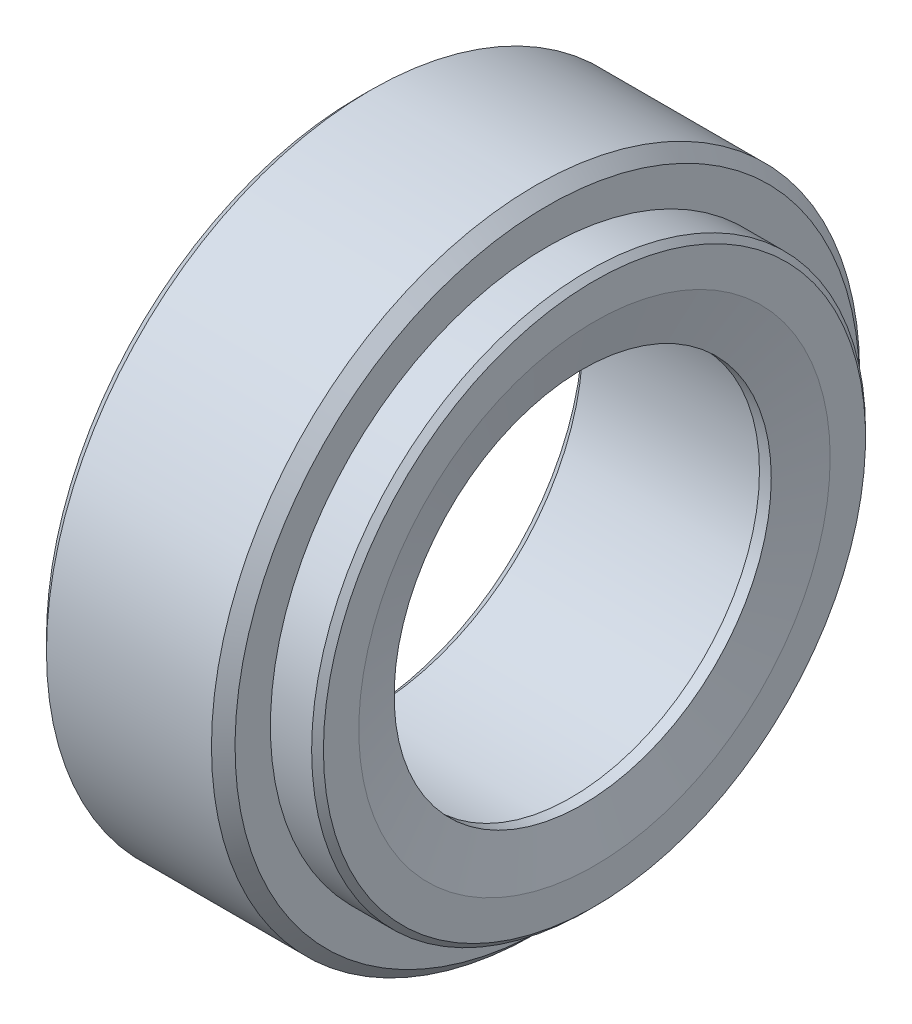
ISO-10303-21;
HEADER;
FILE_DESCRIPTION(('STEP AP214'),'2;1');
FILE_NAME('part.step','',(''),(''),'','','');
FILE_SCHEMA(('AUTOMOTIVE_DESIGN { 1 0 10303 214 1 1 1 1 }'));
ENDSEC;
DATA;
#1=APPLICATION_CONTEXT('core data for automotive mechanical design processes');
#2=APPLICATION_PROTOCOL_DEFINITION('international standard','automotive_design',2000,#1);
#3=PRODUCT_CONTEXT('',#1,'mechanical');
#4=PRODUCT('Part','Part','',(#3));
#5=PRODUCT_RELATED_PRODUCT_CATEGORY('part','',(#4));
#6=PRODUCT_DEFINITION_FORMATION('','',#4);
#7=PRODUCT_DEFINITION_CONTEXT('part definition',#1,'design');
#8=PRODUCT_DEFINITION('design','',#6,#7);
#9=PRODUCT_DEFINITION_SHAPE('','',#8);
#10=(LENGTH_UNIT() NAMED_UNIT(*) SI_UNIT(.MILLI.,.METRE.));
#11=(NAMED_UNIT(*) PLANE_ANGLE_UNIT() SI_UNIT($,.RADIAN.));
#12=(NAMED_UNIT(*) SI_UNIT($,.STERADIAN.) SOLID_ANGLE_UNIT());
#13=UNCERTAINTY_MEASURE_WITH_UNIT(LENGTH_MEASURE(1.E-05),#10,'distance_accuracy_value','');
#14=(GEOMETRIC_REPRESENTATION_CONTEXT(3) GLOBAL_UNCERTAINTY_ASSIGNED_CONTEXT((#13)) GLOBAL_UNIT_ASSIGNED_CONTEXT((#10,
#11,#12)) REPRESENTATION_CONTEXT('',''));
#15=CARTESIAN_POINT('',(0.,0.,0.));
#16=DIRECTION('',(0.,0.,1.));
#17=DIRECTION('',(1.,0.,0.));
#18=AXIS2_PLACEMENT_3D('',#15,#16,#17);
#19=CARTESIAN_POINT('',(4.83168306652,0.,0.));
#20=DIRECTION('',(1.,0.,0.));
#21=DIRECTION('',(0.,0.,-1.));
#22=AXIS2_PLACEMENT_3D('',#19,#20,#21);
#23=CYLINDRICAL_SURFACE('',#22,16.);
#24=CARTESIAN_POINT('',(5.83168306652,0.,0.));
#25=DIRECTION('',(1.,0.,0.));
#26=DIRECTION('',(0.,0.,-1.));
#27=AXIS2_PLACEMENT_3D('',#24,#25,#26);
#28=CIRCLE('',#27,16.);
#29=CARTESIAN_POINT('',(5.83168306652,0.,-16.));
#30=VERTEX_POINT('',#29);
#31=EDGE_CURVE('E77',#30,#30,#28,.T.);
#32=ORIENTED_EDGE('',*,*,#31,.T.);
#33=EDGE_LOOP('',(#32));
#34=FACE_BOUND('',#33,.T.);
#35=CARTESIAN_POINT('',(4.83168306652,0.,0.));
#36=DIRECTION('',(1.,0.,0.));
#37=DIRECTION('',(0.,0.,-1.));
#38=AXIS2_PLACEMENT_3D('',#35,#36,#37);
#39=CIRCLE('',#38,16.);
#40=CARTESIAN_POINT('',(4.83168306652,0.,-16.));
#41=VERTEX_POINT('',#40);
#42=EDGE_CURVE('E21',#41,#41,#39,.T.);
#43=ORIENTED_EDGE('',*,*,#42,.F.);
#44=EDGE_LOOP('',(#43));
#45=FACE_BOUND('',#44,.T.);
#46=ADVANCED_FACE('F17',(#34,#45),#23,.F.);
#47=CARTESIAN_POINT('',(6.83168306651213,0.,0.));
#48=DIRECTION('',(1.,0.,0.));
#49=DIRECTION('',(0.,0.,-1.));
#50=AXIS2_PLACEMENT_3D('',#47,#48,#49);
#51=CONICAL_SURFACE('',#50,20.000000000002,1.32581766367);
#52=ORIENTED_EDGE('',*,*,#31,.F.);
#53=EDGE_LOOP('',(#52));
#54=FACE_BOUND('',#53,.T.);
#55=CARTESIAN_POINT('',(6.83168306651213,0.,0.));
#56=DIRECTION('',(1.,0.,0.));
#57=DIRECTION('',(0.,0.,-1.));
#58=AXIS2_PLACEMENT_3D('',#55,#56,#57);
#59=CIRCLE('',#58,20.000000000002);
#60=CARTESIAN_POINT('',(6.83168306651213,0.,-20.000000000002));
#61=VERTEX_POINT('',#60);
#62=EDGE_CURVE('E102',#61,#61,#59,.F.);
#63=ORIENTED_EDGE('',*,*,#62,.F.);
#64=EDGE_LOOP('',(#63));
#65=FACE_BOUND('',#64,.T.);
#66=ADVANCED_FACE('F113',(#54,#65),#51,.F.);
#67=CARTESIAN_POINT('',(4.83168306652,17.,0.));
#68=DIRECTION('',(-1.,0.,0.));
#69=DIRECTION('',(0.,0.,1.));
#70=AXIS2_PLACEMENT_3D('',#67,#68,#69);
#71=PLANE('',#70);
#72=ORIENTED_EDGE('',*,*,#42,.T.);
#73=EDGE_LOOP('',(#72));
#74=FACE_BOUND('',#73,.T.);
#75=CARTESIAN_POINT('',(4.83168306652,0.,0.));
#76=DIRECTION('',(1.,0.,0.));
#77=DIRECTION('',(0.,0.,-1.));
#78=AXIS2_PLACEMENT_3D('',#75,#76,#77);
#79=CIRCLE('',#78,18.);
#80=CARTESIAN_POINT('',(4.83168306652,0.,-18.));
#81=VERTEX_POINT('',#80);
#82=EDGE_CURVE('E58',#81,#81,#79,.F.);
#83=ORIENTED_EDGE('',*,*,#82,.T.);
#84=EDGE_LOOP('',(#83));
#85=FACE_BOUND('',#84,.T.);
#86=ADVANCED_FACE('F109',(#74,#85),#71,.T.);
#87=CARTESIAN_POINT('',(6.83168306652,21.75,0.));
#88=DIRECTION('',(1.,0.,0.));
#89=DIRECTION('',(0.,0.,-1.));
#90=AXIS2_PLACEMENT_3D('',#87,#88,#89);
#91=PLANE('',#90);
#92=ORIENTED_EDGE('',*,*,#62,.T.);
#93=EDGE_LOOP('',(#92));
#94=FACE_BOUND('',#93,.T.);
#95=CARTESIAN_POINT('',(6.83168306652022,0.,0.));
#96=DIRECTION('',(-1.,0.,0.));
#97=DIRECTION('',(0.,0.,1.));
#98=AXIS2_PLACEMENT_3D('',#95,#96,#97);
#99=CIRCLE('',#98,23.0000000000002);
#100=CARTESIAN_POINT('',(6.83168306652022,0.,23.0000000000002));
#101=VERTEX_POINT('',#100);
#102=EDGE_CURVE('E76',#101,#101,#99,.T.);
#103=ORIENTED_EDGE('',*,*,#102,.F.);
#104=EDGE_LOOP('',(#103));
#105=FACE_BOUND('',#104,.T.);
#106=ADVANCED_FACE('F185',(#94,#105),#91,.T.);
#107=CARTESIAN_POINT('',(-12.1683169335,0.,0.));
#108=DIRECTION('',(1.,0.,0.));
#109=DIRECTION('',(0.,0.,-1.));
#110=AXIS2_PLACEMENT_3D('',#107,#108,#109);
#111=CYLINDRICAL_SURFACE('',#110,18.);
#112=CARTESIAN_POINT('',(-12.1683169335,0.,0.));
#113=DIRECTION('',(-1.,0.,0.));
#114=DIRECTION('',(0.,0.,1.));
#115=AXIS2_PLACEMENT_3D('',#112,#113,#114);
#116=CIRCLE('',#115,18.);
#117=CARTESIAN_POINT('',(-12.1683169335,0.,18.));
#118=VERTEX_POINT('',#117);
#119=EDGE_CURVE('E73',#118,#118,#116,.T.);
#120=ORIENTED_EDGE('',*,*,#119,.T.);
#121=EDGE_LOOP('',(#120));
#122=FACE_BOUND('',#121,.T.);
#123=ORIENTED_EDGE('',*,*,#82,.F.);
#124=EDGE_LOOP('',(#123));
#125=FACE_BOUND('',#124,.T.);
#126=ADVANCED_FACE('F182',(#122,#125),#111,.F.);
#127=CARTESIAN_POINT('',(-5.16831693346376,-0.0258203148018,21.999984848));
#128=DIRECTION('',(-1.,0.,0.));
#129=DIRECTION('',(0.,0.,1.));
#130=AXIS2_PLACEMENT_3D('',#127,#128,#129);
#131=CONICAL_SURFACE('',#130,1.49999999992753,1.02974425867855);
#132=DIRECTION('',(0.515038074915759,0.,0.857167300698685));
#133=VECTOR('',#132,1.);
#134=CARTESIAN_POINT('',(-299820.497000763,-0.0258203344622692,-498956.000030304));
#135=LINE('',#134,#133);
#136=CARTESIAN_POINT('',(-4.26702600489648,-0.0258203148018,21.9999848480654));
#137=VERTEX_POINT('',#136);
#138=CARTESIAN_POINT('',(-5.16831693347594,-0.0258203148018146,20.4999848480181));
#139=VERTEX_POINT('',#138);
#140=EDGE_CURVE('E52',#137,#139,#135,.F.);
#141=ORIENTED_EDGE('',*,*,#140,.T.);
#142=CARTESIAN_POINT('',(-5.16831693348,-0.0258203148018,21.999984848));
#143=DIRECTION('',(-1.,0.,0.));
#144=DIRECTION('',(0.,0.,1.));
#145=AXIS2_PLACEMENT_3D('',#142,#143,#144);
#146=CIRCLE('',#145,1.5);
#147=CARTESIAN_POINT('',(-5.16831693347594,-0.0258203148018,23.4999848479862));
#148=VERTEX_POINT('',#147);
#149=EDGE_CURVE('E55',#139,#148,#146,.T.);
#150=ORIENTED_EDGE('',*,*,#149,.T.);
#151=DIRECTION('',(0.515038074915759,0.,-0.857167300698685));
#152=VECTOR('',#151,1.);
#153=CARTESIAN_POINT('',(-299820.497000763,-0.0258203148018,499000.));
#154=LINE('',#153,#152);
#155=EDGE_CURVE('E49',#148,#137,#154,.T.);
#156=ORIENTED_EDGE('',*,*,#155,.T.);
#157=EDGE_LOOP('',(#141,#150,#156));
#158=FACE_BOUND('',#157,.T.);
#159=ADVANCED_FACE('F51',(#158),#131,.F.);
#160=CARTESIAN_POINT('',(-5.16831693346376,-0.0258203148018,21.999984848));
#161=DIRECTION('',(-1.,0.,0.));
#162=DIRECTION('',(0.,0.,1.));
#163=AXIS2_PLACEMENT_3D('',#160,#161,#162);
#164=CONICAL_SURFACE('',#163,1.49999999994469,1.02974425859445);
#165=ORIENTED_EDGE('',*,*,#155,.F.);
#166=CARTESIAN_POINT('',(-5.16831693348,-0.0258203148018,21.999984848));
#167=DIRECTION('',(-1.,0.,0.));
#168=DIRECTION('',(0.,0.,1.));
#169=AXIS2_PLACEMENT_3D('',#166,#167,#168);
#170=CIRCLE('',#169,1.5);
#171=EDGE_CURVE('E61',#148,#139,#170,.T.);
#172=ORIENTED_EDGE('',*,*,#171,.T.);
#173=ORIENTED_EDGE('',*,*,#140,.F.);
#174=EDGE_LOOP('',(#165,#172,#173));
#175=FACE_BOUND('',#174,.T.);
#176=ADVANCED_FACE('F60',(#175),#164,.F.);
#177=CARTESIAN_POINT('',(-5.1683169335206,-0.0258203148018,-21.999984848));
#178=DIRECTION('',(-1.,0.,0.));
#179=DIRECTION('',(0.,0.,1.));
#180=AXIS2_PLACEMENT_3D('',#177,#178,#179);
#181=CONICAL_SURFACE('',#180,1.49999999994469,1.02974425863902);
#182=DIRECTION('',(0.515038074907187,0.,0.857167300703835));
#183=VECTOR('',#182,1.);
#184=CARTESIAN_POINT('',(-299846.934843,-0.0258203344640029,-499043.999969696));
#185=LINE('',#184,#183);
#186=CARTESIAN_POINT('',(-4.26702600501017,-0.0258203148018,-21.9999848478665));
#187=VERTEX_POINT('',#186);
#188=CARTESIAN_POINT('',(-5.16831693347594,-0.0258203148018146,-23.4999848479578));
#189=VERTEX_POINT('',#188);
#190=EDGE_CURVE('E36',#187,#189,#185,.F.);
#191=ORIENTED_EDGE('',*,*,#190,.T.);
#192=CARTESIAN_POINT('',(-5.16831693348,-0.0258203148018,-21.999984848));
#193=DIRECTION('',(-1.,0.,0.));
#194=DIRECTION('',(0.,0.,1.));
#195=AXIS2_PLACEMENT_3D('',#192,#193,#194);
#196=CIRCLE('',#195,1.5);
#197=CARTESIAN_POINT('',(-5.16831693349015,-0.0258203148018,-20.4999848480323));
#198=VERTEX_POINT('',#197);
#199=EDGE_CURVE('E282',#189,#198,#196,.T.);
#200=ORIENTED_EDGE('',*,*,#199,.T.);
#201=DIRECTION('',(0.515038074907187,0.,-0.857167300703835));
#202=VECTOR('',#201,1.);
#203=CARTESIAN_POINT('',(-299846.934843,-0.0258203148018,499000.));
#204=LINE('',#203,#202);
#205=EDGE_CURVE('E62',#198,#187,#204,.T.);
#206=ORIENTED_EDGE('',*,*,#205,.T.);
#207=EDGE_LOOP('',(#191,#200,#206));
#208=FACE_BOUND('',#207,.T.);
#209=ADVANCED_FACE('F174',(#208),#181,.F.);
#210=CARTESIAN_POINT('',(-5.16831693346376,-0.0258203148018,-21.999984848));
#211=DIRECTION('',(-1.,0.,0.));
#212=DIRECTION('',(0.,0.,1.));
#213=AXIS2_PLACEMENT_3D('',#210,#211,#212);
#214=CONICAL_SURFACE('',#213,1.49999999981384,1.02974425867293);
#215=ORIENTED_EDGE('',*,*,#205,.F.);
#216=CARTESIAN_POINT('',(-5.16831693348,-0.0258203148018,-21.999984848));
#217=DIRECTION('',(-1.,0.,0.));
#218=DIRECTION('',(0.,0.,1.));
#219=AXIS2_PLACEMENT_3D('',#216,#217,#218);
#220=CIRCLE('',#219,1.5);
#221=EDGE_CURVE('E281',#198,#189,#220,.T.);
#222=ORIENTED_EDGE('',*,*,#221,.T.);
#223=ORIENTED_EDGE('',*,*,#190,.F.);
#224=EDGE_LOOP('',(#215,#222,#223));
#225=FACE_BOUND('',#224,.T.);
#226=ADVANCED_FACE('F170',(#225),#214,.F.);
#227=CARTESIAN_POINT('',(6.33168306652,0.,0.));
#228=DIRECTION('',(-1.,0.,0.));
#229=DIRECTION('',(0.,0.,1.));
#230=AXIS2_PLACEMENT_3D('',#227,#228,#229);
#231=CONICAL_SURFACE('',#230,23.5,0.785398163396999);
#232=CARTESIAN_POINT('',(6.33168306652,0.,0.));
#233=DIRECTION('',(1.,0.,0.));
#234=DIRECTION('',(0.,0.,-1.));
#235=AXIS2_PLACEMENT_3D('',#232,#233,#234);
#236=CIRCLE('',#235,23.5);
#237=CARTESIAN_POINT('',(6.33168306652,0.,-23.5));
#238=VERTEX_POINT('',#237);
#239=EDGE_CURVE('E98',#238,#238,#236,.F.);
#240=ORIENTED_EDGE('',*,*,#239,.F.);
#241=EDGE_LOOP('',(#240));
#242=FACE_BOUND('',#241,.T.);
#243=ORIENTED_EDGE('',*,*,#102,.T.);
#244=EDGE_LOOP('',(#243));
#245=FACE_BOUND('',#244,.T.);
#246=ADVANCED_FACE('F166',(#242,#245),#231,.T.);
#247=CARTESIAN_POINT('',(-13.1683169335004,0.,0.));
#248=DIRECTION('',(-1.,0.,0.));
#249=DIRECTION('',(0.,0.,1.));
#250=AXIS2_PLACEMENT_3D('',#247,#248,#249);
#251=CONICAL_SURFACE('',#250,18.9999999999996,0.785398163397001);
#252=ORIENTED_EDGE('',*,*,#119,.F.);
#253=EDGE_LOOP('',(#252));
#254=FACE_BOUND('',#253,.T.);
#255=CARTESIAN_POINT('',(-13.1683169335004,0.,0.));
#256=DIRECTION('',(-1.,0.,0.));
#257=DIRECTION('',(0.,0.,1.));
#258=AXIS2_PLACEMENT_3D('',#255,#256,#257);
#259=CIRCLE('',#258,18.9999999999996);
#260=CARTESIAN_POINT('',(-13.1683169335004,0.,18.9999999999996));
#261=VERTEX_POINT('',#260);
#262=EDGE_CURVE('E95',#261,#261,#259,.F.);
#263=ORIENTED_EDGE('',*,*,#262,.F.);
#264=EDGE_LOOP('',(#263));
#265=FACE_BOUND('',#264,.T.);
#266=ADVANCED_FACE('F162',(#254,#265),#251,.F.);
#267=CARTESIAN_POINT('',(-9.16831693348,-0.0258203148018,21.999984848));
#268=DIRECTION('',(-1.,0.,0.));
#269=DIRECTION('',(0.,0.,1.));
#270=AXIS2_PLACEMENT_3D('',#267,#268,#269);
#271=CYLINDRICAL_SURFACE('',#270,1.5);
#272=ORIENTED_EDGE('',*,*,#171,.F.);
#273=ORIENTED_EDGE('',*,*,#149,.F.);
#274=EDGE_LOOP('',(#272,#273));
#275=FACE_BOUND('',#274,.T.);
#276=CARTESIAN_POINT('',(-13.1683169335,-0.0258203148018,21.999984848));
#277=DIRECTION('',(-1.,0.,0.));
#278=DIRECTION('',(0.,0.,1.));
#279=AXIS2_PLACEMENT_3D('',#276,#277,#278);
#280=CIRCLE('',#279,1.5);
#281=CARTESIAN_POINT('',(-13.1683169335,-0.0258203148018,23.499984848));
#282=VERTEX_POINT('',#281);
#283=EDGE_CURVE('E92',#282,#282,#280,.F.);
#284=ORIENTED_EDGE('',*,*,#283,.F.);
#285=EDGE_LOOP('',(#284));
#286=FACE_BOUND('',#285,.T.);
#287=ADVANCED_FACE('F158',(#275,#286),#271,.F.);
#288=CARTESIAN_POINT('',(-9.16831693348,-0.0258203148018,-21.999984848));
#289=DIRECTION('',(-1.,0.,0.));
#290=DIRECTION('',(0.,0.,1.));
#291=AXIS2_PLACEMENT_3D('',#288,#289,#290);
#292=CYLINDRICAL_SURFACE('',#291,1.5);
#293=ORIENTED_EDGE('',*,*,#221,.F.);
#294=ORIENTED_EDGE('',*,*,#199,.F.);
#295=EDGE_LOOP('',(#293,#294));
#296=FACE_BOUND('',#295,.T.);
#297=CARTESIAN_POINT('',(-13.1683169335,-0.0258203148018,-21.999984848));
#298=DIRECTION('',(-1.,0.,0.));
#299=DIRECTION('',(0.,0.,1.));
#300=AXIS2_PLACEMENT_3D('',#297,#298,#299);
#301=CIRCLE('',#300,1.5);
#302=CARTESIAN_POINT('',(-13.1683169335,-0.0258203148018,-20.499984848));
#303=VERTEX_POINT('',#302);
#304=EDGE_CURVE('E89',#303,#303,#301,.F.);
#305=ORIENTED_EDGE('',*,*,#304,.F.);
#306=EDGE_LOOP('',(#305));
#307=FACE_BOUND('',#306,.T.);
#308=ADVANCED_FACE('F154',(#296,#307),#292,.F.);
#309=CARTESIAN_POINT('',(4.83168306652,0.,0.));
#310=DIRECTION('',(1.,0.,0.));
#311=DIRECTION('',(0.,0.,-1.));
#312=AXIS2_PLACEMENT_3D('',#309,#310,#311);
#313=CYLINDRICAL_SURFACE('',#312,23.5);
#314=ORIENTED_EDGE('',*,*,#239,.T.);
#315=EDGE_LOOP('',(#314));
#316=FACE_BOUND('',#315,.T.);
#317=CARTESIAN_POINT('',(2.83168306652,0.,0.));
#318=DIRECTION('',(1.,0.,0.));
#319=DIRECTION('',(0.,0.,-1.));
#320=AXIS2_PLACEMENT_3D('',#317,#318,#319);
#321=CIRCLE('',#320,23.5);
#322=CARTESIAN_POINT('',(2.83168306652,0.,-23.5));
#323=VERTEX_POINT('',#322);
#324=EDGE_CURVE('E86',#323,#323,#321,.F.);
#325=ORIENTED_EDGE('',*,*,#324,.F.);
#326=EDGE_LOOP('',(#325));
#327=FACE_BOUND('',#326,.T.);
#328=ADVANCED_FACE('F148',(#316,#327),#313,.T.);
#329=CARTESIAN_POINT('',(-13.1683169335,22.75,0.));
#330=DIRECTION('',(-1.,0.,0.));
#331=DIRECTION('',(0.,0.,1.));
#332=AXIS2_PLACEMENT_3D('',#329,#330,#331);
#333=PLANE('',#332);
#334=ORIENTED_EDGE('',*,*,#304,.T.);
#335=EDGE_LOOP('',(#334));
#336=FACE_BOUND('',#335,.T.);
#337=ORIENTED_EDGE('',*,*,#283,.T.);
#338=EDGE_LOOP('',(#337));
#339=FACE_BOUND('',#338,.T.);
#340=ORIENTED_EDGE('',*,*,#262,.T.);
#341=EDGE_LOOP('',(#340));
#342=FACE_BOUND('',#341,.T.);
#343=CARTESIAN_POINT('',(-13.1683169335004,0.,0.));
#344=DIRECTION('',(1.,0.,0.));
#345=DIRECTION('',(0.,1.,0.));
#346=AXIS2_PLACEMENT_3D('',#343,#344,#345);
#347=CIRCLE('',#346,26.5000000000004);
#348=CARTESIAN_POINT('',(-13.1683169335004,26.5000000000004,0.));
#349=VERTEX_POINT('',#348);
#350=EDGE_CURVE('E83',#349,#349,#347,.T.);
#351=ORIENTED_EDGE('',*,*,#350,.F.);
#352=EDGE_LOOP('',(#351));
#353=FACE_BOUND('',#352,.T.);
#354=ADVANCED_FACE('F139',(#336,#339,#342,#353),#333,.T.);
#355=CARTESIAN_POINT('',(2.83168306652,25.5,0.));
#356=DIRECTION('',(1.,0.,0.));
#357=DIRECTION('',(0.,0.,-1.));
#358=AXIS2_PLACEMENT_3D('',#355,#356,#357);
#359=PLANE('',#358);
#360=ORIENTED_EDGE('',*,*,#324,.T.);
#361=EDGE_LOOP('',(#360));
#362=FACE_BOUND('',#361,.T.);
#363=CARTESIAN_POINT('',(2.83168306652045,0.,0.));
#364=DIRECTION('',(-1.,0.,0.));
#365=DIRECTION('',(0.,-1.,0.));
#366=AXIS2_PLACEMENT_3D('',#363,#364,#365);
#367=CIRCLE('',#366,26.5000000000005);
#368=CARTESIAN_POINT('',(2.83168306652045,-26.5000000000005,0.));
#369=VERTEX_POINT('',#368);
#370=EDGE_CURVE('E80',#369,#369,#367,.T.);
#371=ORIENTED_EDGE('',*,*,#370,.F.);
#372=EDGE_LOOP('',(#371));
#373=FACE_BOUND('',#372,.T.);
#374=ADVANCED_FACE('F137',(#362,#373),#359,.T.);
#375=CARTESIAN_POINT('',(-12.1683169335,0.,0.));
#376=DIRECTION('',(1.,0.,0.));
#377=DIRECTION('',(0.,1.,0.));
#378=AXIS2_PLACEMENT_3D('',#375,#376,#377);
#379=CONICAL_SURFACE('',#378,27.5,0.785398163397);
#380=ORIENTED_EDGE('',*,*,#350,.T.);
#381=EDGE_LOOP('',(#380));
#382=FACE_BOUND('',#381,.T.);
#383=CARTESIAN_POINT('',(-12.1683169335,0.,0.));
#384=DIRECTION('',(1.,0.,0.));
#385=DIRECTION('',(0.,0.,-1.));
#386=AXIS2_PLACEMENT_3D('',#383,#384,#385);
#387=CIRCLE('',#386,27.5);
#388=CARTESIAN_POINT('',(-12.1683169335,0.,-27.5));
#389=VERTEX_POINT('',#388);
#390=EDGE_CURVE('E27',#389,#389,#387,.T.);
#391=ORIENTED_EDGE('',*,*,#390,.F.);
#392=EDGE_LOOP('',(#391));
#393=FACE_BOUND('',#392,.T.);
#394=ADVANCED_FACE('F128',(#382,#393),#379,.T.);
#395=CARTESIAN_POINT('',(1.83168306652,0.,0.));
#396=DIRECTION('',(-1.,0.,0.));
#397=DIRECTION('',(0.,-1.,0.));
#398=AXIS2_PLACEMENT_3D('',#395,#396,#397);
#399=CONICAL_SURFACE('',#398,27.5,0.785398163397);
#400=CARTESIAN_POINT('',(1.83168306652,0.,0.));
#401=DIRECTION('',(1.,0.,0.));
#402=DIRECTION('',(0.,0.,-1.));
#403=AXIS2_PLACEMENT_3D('',#400,#401,#402);
#404=CIRCLE('',#403,27.5);
#405=CARTESIAN_POINT('',(1.83168306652,0.,-27.5));
#406=VERTEX_POINT('',#405);
#407=EDGE_CURVE('E11',#406,#406,#404,.F.);
#408=ORIENTED_EDGE('',*,*,#407,.F.);
#409=EDGE_LOOP('',(#408));
#410=FACE_BOUND('',#409,.T.);
#411=ORIENTED_EDGE('',*,*,#370,.T.);
#412=EDGE_LOOP('',(#411));
#413=FACE_BOUND('',#412,.T.);
#414=ADVANCED_FACE('F123',(#410,#413),#399,.T.);
#415=CARTESIAN_POINT('',(-5.16831693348,0.,0.));
#416=DIRECTION('',(1.,0.,0.));
#417=DIRECTION('',(0.,0.,-1.));
#418=AXIS2_PLACEMENT_3D('',#415,#416,#417);
#419=CYLINDRICAL_SURFACE('',#418,27.5);
#420=ORIENTED_EDGE('',*,*,#390,.T.);
#421=EDGE_LOOP('',(#420));
#422=FACE_BOUND('',#421,.T.);
#423=ORIENTED_EDGE('',*,*,#407,.T.);
#424=EDGE_LOOP('',(#423));
#425=FACE_BOUND('',#424,.T.);
#426=ADVANCED_FACE('F19',(#422,#425),#419,.T.);
#427=CLOSED_SHELL('',(#46,#66,#86,#106,#126,#159,#176,#209,#226,#246,#266,#287,#308,#328,#354,
#374,#394,#414,#426));
#428=MANIFOLD_SOLID_BREP('B1',#427);
#429=ADVANCED_BREP_SHAPE_REPRESENTATION('',(#18,#428),#14);
#430=SHAPE_DEFINITION_REPRESENTATION(#9,#429);
ENDSEC;
END-ISO-10303-21;
